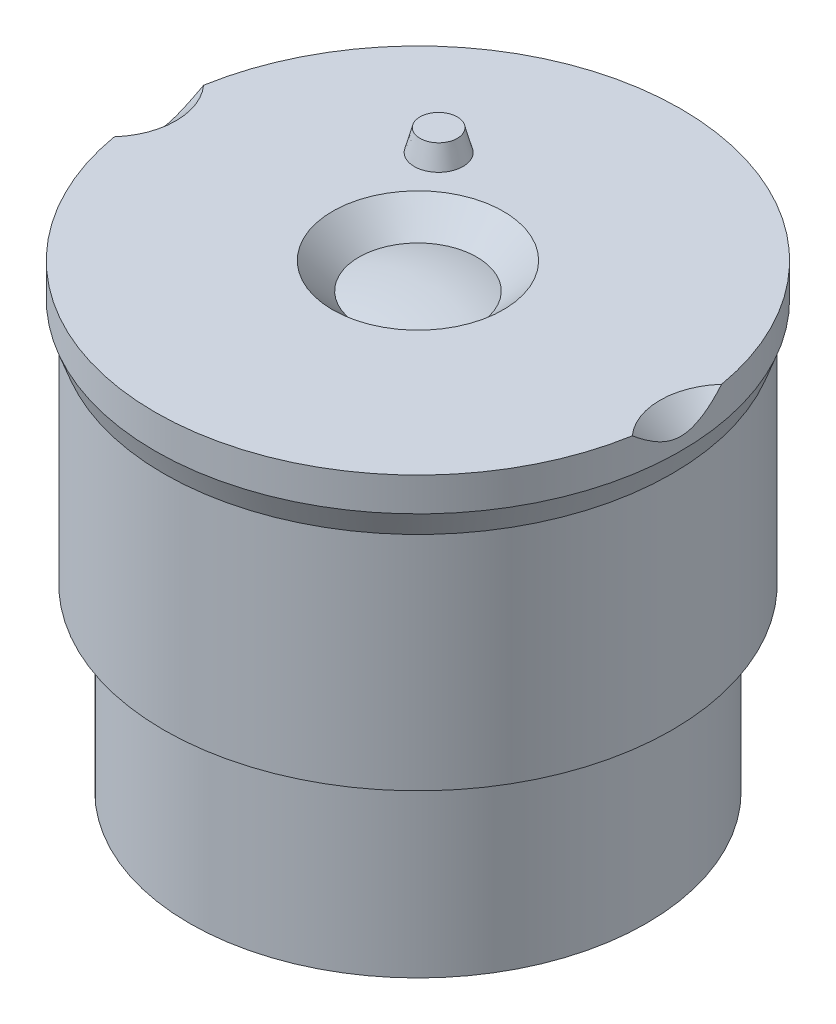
ISO-10303-21;
HEADER;
FILE_DESCRIPTION(('STEP AP214'),'2;1');
FILE_NAME('part.step','',(''),(''),'','','');
FILE_SCHEMA(('AUTOMOTIVE_DESIGN { 1 0 10303 214 1 1 1 1 }'));
ENDSEC;
DATA;
#1=APPLICATION_CONTEXT('core data for automotive mechanical design processes');
#2=APPLICATION_PROTOCOL_DEFINITION('international standard','automotive_design',2000,#1);
#3=PRODUCT_CONTEXT('',#1,'mechanical');
#4=PRODUCT('Part','Part','',(#3));
#5=PRODUCT_RELATED_PRODUCT_CATEGORY('part','',(#4));
#6=PRODUCT_DEFINITION_FORMATION('','',#4);
#7=PRODUCT_DEFINITION_CONTEXT('part definition',#1,'design');
#8=PRODUCT_DEFINITION('design','',#6,#7);
#9=PRODUCT_DEFINITION_SHAPE('','',#8);
#10=(LENGTH_UNIT() NAMED_UNIT(*) SI_UNIT(.MILLI.,.METRE.));
#11=(NAMED_UNIT(*) PLANE_ANGLE_UNIT() SI_UNIT($,.RADIAN.));
#12=(NAMED_UNIT(*) SI_UNIT($,.STERADIAN.) SOLID_ANGLE_UNIT());
#13=UNCERTAINTY_MEASURE_WITH_UNIT(LENGTH_MEASURE(1.E-05),#10,'distance_accuracy_value','');
#14=(GEOMETRIC_REPRESENTATION_CONTEXT(3) GLOBAL_UNCERTAINTY_ASSIGNED_CONTEXT((#13)) GLOBAL_UNIT_ASSIGNED_CONTEXT((#10,
#11,#12)) REPRESENTATION_CONTEXT('',''));
#15=CARTESIAN_POINT('',(0.,0.,0.));
#16=DIRECTION('',(0.,0.,1.));
#17=DIRECTION('',(1.,0.,0.));
#18=AXIS2_PLACEMENT_3D('',#15,#16,#17);
#19=CARTESIAN_POINT('',(0.,0.,0.));
#20=DIRECTION('',(0.,1.,0.));
#21=DIRECTION('',(0.,0.,1.));
#22=AXIS2_PLACEMENT_3D('',#19,#20,#21);
#23=CYLINDRICAL_SURFACE('',#22,19.55);
#24=CARTESIAN_POINT('',(0.,31.7,0.));
#25=DIRECTION('',(0.,1.,0.));
#26=DIRECTION('',(0.,0.,1.));
#27=AXIS2_PLACEMENT_3D('',#24,#25,#26);
#28=CIRCLE('',#27,19.55);
#29=CARTESIAN_POINT('',(0.,31.7,19.55));
#30=VERTEX_POINT('',#29);
#31=EDGE_CURVE('E89',#30,#30,#28,.T.);
#32=ORIENTED_EDGE('',*,*,#31,.T.);
#33=EDGE_LOOP('',(#32));
#34=FACE_BOUND('',#33,.T.);
#35=CARTESIAN_POINT('',(0.,34.2,0.));
#36=DIRECTION('',(0.,1.,0.));
#37=DIRECTION('',(0.,0.,1.));
#38=AXIS2_PLACEMENT_3D('',#35,#36,#37);
#39=CIRCLE('',#38,19.55);
#40=CARTESIAN_POINT('',(19.2652717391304,34.2,-3.32442548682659));
#41=VERTEX_POINT('',#40);
#42=CARTESIAN_POINT('',(-19.2652717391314,34.2,-3.32442548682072));
#43=VERTEX_POINT('',#42);
#44=EDGE_CURVE('E67',#41,#43,#39,.T.);
#45=ORIENTED_EDGE('',*,*,#44,.F.);
#46=CARTESIAN_POINT('',(19.26522826,34.2002,-3.32467744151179));
#47=CARTESIAN_POINT('',(19.277858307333,34.142108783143,-3.25148476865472));
#48=CARTESIAN_POINT('',(19.2901471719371,34.0845652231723,-3.17779283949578));
#49=CARTESIAN_POINT('',(19.3140284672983,33.9707877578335,-3.02926952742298));
#50=CARTESIAN_POINT('',(19.3256207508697,33.9145541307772,-2.95443790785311));
#51=CARTESIAN_POINT('',(19.3481505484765,33.8033340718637,-2.80311484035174));
#52=CARTESIAN_POINT('',(19.3590841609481,33.7483560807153,-2.72661658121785));
#53=CARTESIAN_POINT('',(19.3802035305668,33.6402774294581,-2.57221245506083));
#54=CARTESIAN_POINT('',(19.3903893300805,33.5871766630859,-2.49430666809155));
#55=CARTESIAN_POINT('',(19.4205753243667,33.4270182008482,-2.25189362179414));
#56=CARTESIAN_POINT('',(19.439290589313,33.3236424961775,-2.08475128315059));
#57=CARTESIAN_POINT('',(19.4729691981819,33.1313000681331,-1.74226302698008));
#58=CARTESIAN_POINT('',(19.4879412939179,33.0422999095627,-1.56693740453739));
#59=CARTESIAN_POINT('',(19.5069110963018,32.9263968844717,-1.30017117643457));
#60=CARTESIAN_POINT('',(19.5125708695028,32.8912436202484,-1.2124360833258));
#61=CARTESIAN_POINT('',(19.5228026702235,32.8269278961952,-1.03469822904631));
#62=CARTESIAN_POINT('',(19.5273746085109,32.7977659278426,-0.94469528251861));
#63=CARTESIAN_POINT('',(19.5352915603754,32.74679231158,-0.76355316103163));
#64=CARTESIAN_POINT('',(19.5386486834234,32.7249083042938,-0.672435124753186));
#65=CARTESIAN_POINT('',(19.5441091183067,32.6890978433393,-0.488617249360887));
#66=CARTESIAN_POINT('',(19.5462128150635,32.675168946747,-0.395917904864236));
#67=CARTESIAN_POINT('',(19.5491186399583,32.6558848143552,-0.208284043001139));
#68=CARTESIAN_POINT('',(19.5499021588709,32.6506521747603,-0.11333639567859));
#69=CARTESIAN_POINT('',(19.5500805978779,32.6494627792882,0.0766155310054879));
#70=CARTESIAN_POINT('',(19.549475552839,32.6535057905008,0.171619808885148));
#71=CARTESIAN_POINT('',(19.5468955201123,32.670644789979,0.361079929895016));
#72=CARTESIAN_POINT('',(19.5449162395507,32.6837691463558,0.455533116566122));
#73=CARTESIAN_POINT('',(19.5396531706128,32.7183458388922,0.642844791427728));
#74=CARTESIAN_POINT('',(19.5363691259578,32.7397998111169,0.735702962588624));
#75=CARTESIAN_POINT('',(19.5220306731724,32.832291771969,1.07407137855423));
#76=CARTESIAN_POINT('',(19.5072039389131,32.9259896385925,1.3133207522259));
#77=CARTESIAN_POINT('',(19.4797479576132,33.0906545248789,1.6599920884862));
#78=CARTESIAN_POINT('',(19.4696831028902,33.1498070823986,1.77388446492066));
#79=CARTESIAN_POINT('',(19.4479522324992,33.2743781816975,1.99807257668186));
#80=CARTESIAN_POINT('',(19.4362865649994,33.3397953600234,2.1083690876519));
#81=CARTESIAN_POINT('',(19.4127719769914,33.4683353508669,2.31438782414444));
#82=CARTESIAN_POINT('',(19.401069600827,33.5309835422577,2.41042858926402));
#83=CARTESIAN_POINT('',(19.3765366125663,33.659365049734,2.60028556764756));
#84=CARTESIAN_POINT('',(19.3637059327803,33.7250985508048,2.69410164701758));
#85=CARTESIAN_POINT('',(19.3371741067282,33.8579857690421,2.8783202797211));
#86=CARTESIAN_POINT('',(19.323489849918,33.9251008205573,2.96875332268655));
#87=CARTESIAN_POINT('',(19.2951103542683,34.0612843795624,3.14792210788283));
#88=CARTESIAN_POINT('',(19.2804155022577,34.1303521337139,3.23665848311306));
#89=CARTESIAN_POINT('',(19.26522826,34.2002,3.32467744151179));
#90=B_SPLINE_CURVE_WITH_KNOTS('',3,(#46,#47,#48,#49,#50,#51,#52,#53,#54,#55,#56,#57,#58,#59,#60,
#61,#62,#63,#64,#65,#66,#67,#68,#69,#70,#71,#72,#73,#74,#75,#76,#77,#78,#79,#80,#81,#82,#83,#84,
#85,#86,#87,#88,#89),.UNSPECIFIED.,.F.,.F.,(4,2,2,2,2,2,2,2,2,2,2,2,2,2,2,2,2,2,2,2,2,4),(0.,
0.28288343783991,0.565826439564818,0.850307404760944,1.13477224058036,1.72654684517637,
2.3169246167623,2.60080035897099,2.88469937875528,3.16568496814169,3.44658422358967,
3.73141089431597,4.01623041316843,4.30194368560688,4.58771310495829,5.35470851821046,
5.74086173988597,6.12693110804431,6.47265587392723,6.81840139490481,7.15870229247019,
7.4988736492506),.UNSPECIFIED.);
#91=CARTESIAN_POINT('',(19.2652717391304,34.2,3.32442548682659));
#92=VERTEX_POINT('',#91);
#93=EDGE_CURVE('E60',#41,#92,#90,.T.);
#94=ORIENTED_EDGE('',*,*,#93,.T.);
#95=CARTESIAN_POINT('',(-19.2652717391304,34.2,3.32442548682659));
#96=VERTEX_POINT('',#95);
#97=EDGE_CURVE('E80',#96,#92,#39,.T.);
#98=ORIENTED_EDGE('',*,*,#97,.F.);
#99=CARTESIAN_POINT('',(-19.26522826,34.2002,3.32467744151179));
#100=CARTESIAN_POINT('',(-19.277858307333,34.142108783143,3.25148476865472));
#101=CARTESIAN_POINT('',(-19.2901471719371,34.0845652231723,3.17779283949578));
#102=CARTESIAN_POINT('',(-19.3140284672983,33.9707877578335,3.02926952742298));
#103=CARTESIAN_POINT('',(-19.3256207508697,33.9145541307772,2.95443790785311));
#104=CARTESIAN_POINT('',(-19.3481505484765,33.8033340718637,2.80311484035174));
#105=CARTESIAN_POINT('',(-19.3590841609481,33.7483560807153,2.72661658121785));
#106=CARTESIAN_POINT('',(-19.3802035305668,33.6402774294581,2.57221245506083));
#107=CARTESIAN_POINT('',(-19.3903893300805,33.5871766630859,2.49430666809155));
#108=CARTESIAN_POINT('',(-19.4205753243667,33.4270182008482,2.25189362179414));
#109=CARTESIAN_POINT('',(-19.439290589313,33.3236424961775,2.08475128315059));
#110=CARTESIAN_POINT('',(-19.4729691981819,33.1313000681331,1.74226302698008));
#111=CARTESIAN_POINT('',(-19.4879412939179,33.0422999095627,1.56693740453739));
#112=CARTESIAN_POINT('',(-19.5069110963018,32.9263968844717,1.30017117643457));
#113=CARTESIAN_POINT('',(-19.5125708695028,32.8912436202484,1.2124360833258));
#114=CARTESIAN_POINT('',(-19.5228026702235,32.8269278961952,1.03469822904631));
#115=CARTESIAN_POINT('',(-19.5273746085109,32.7977659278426,0.94469528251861));
#116=CARTESIAN_POINT('',(-19.5352915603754,32.74679231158,0.76355316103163));
#117=CARTESIAN_POINT('',(-19.5386486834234,32.7249083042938,0.672435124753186));
#118=CARTESIAN_POINT('',(-19.5441091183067,32.6890978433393,0.488617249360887));
#119=CARTESIAN_POINT('',(-19.5462128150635,32.675168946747,0.395917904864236));
#120=CARTESIAN_POINT('',(-19.5491186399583,32.6558848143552,0.208284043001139));
#121=CARTESIAN_POINT('',(-19.5499021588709,32.6506521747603,0.11333639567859));
#122=CARTESIAN_POINT('',(-19.5500805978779,32.6494627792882,-0.0766155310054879));
#123=CARTESIAN_POINT('',(-19.549475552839,32.6535057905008,-0.171619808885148));
#124=CARTESIAN_POINT('',(-19.5468955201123,32.670644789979,-0.361079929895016));
#125=CARTESIAN_POINT('',(-19.5449162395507,32.6837691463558,-0.455533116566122));
#126=CARTESIAN_POINT('',(-19.5396531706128,32.7183458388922,-0.642844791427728));
#127=CARTESIAN_POINT('',(-19.5363691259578,32.7397998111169,-0.735702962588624));
#128=CARTESIAN_POINT('',(-19.5220306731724,32.832291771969,-1.07407137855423));
#129=CARTESIAN_POINT('',(-19.5072039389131,32.9259896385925,-1.3133207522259));
#130=CARTESIAN_POINT('',(-19.4797479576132,33.0906545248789,-1.6599920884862));
#131=CARTESIAN_POINT('',(-19.4696831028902,33.1498070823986,-1.77388446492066));
#132=CARTESIAN_POINT('',(-19.4479522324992,33.2743781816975,-1.99807257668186));
#133=CARTESIAN_POINT('',(-19.4362865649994,33.3397953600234,-2.1083690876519));
#134=CARTESIAN_POINT('',(-19.4127719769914,33.4683353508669,-2.31438782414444));
#135=CARTESIAN_POINT('',(-19.401069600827,33.5309835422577,-2.41042858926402));
#136=CARTESIAN_POINT('',(-19.3765366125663,33.659365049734,-2.60028556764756));
#137=CARTESIAN_POINT('',(-19.3637059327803,33.7250985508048,-2.69410164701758));
#138=CARTESIAN_POINT('',(-19.3371741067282,33.8579857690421,-2.8783202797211));
#139=CARTESIAN_POINT('',(-19.323489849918,33.9251008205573,-2.96875332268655));
#140=CARTESIAN_POINT('',(-19.2951103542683,34.0612843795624,-3.14792210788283));
#141=CARTESIAN_POINT('',(-19.2804155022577,34.1303521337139,-3.23665848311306));
#142=CARTESIAN_POINT('',(-19.26522826,34.2002,-3.32467744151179));
#143=B_SPLINE_CURVE_WITH_KNOTS('',3,(#99,#100,#101,#102,#103,#104,#105,#106,#107,#108,#109,#110,
#111,#112,#113,#114,#115,#116,#117,#118,#119,#120,#121,#122,#123,#124,#125,#126,#127,#128,#129,
#130,#131,#132,#133,#134,#135,#136,#137,#138,#139,#140,#141,#142),.UNSPECIFIED.,.F.,.F.,(4,2,2,
2,2,2,2,2,2,2,2,2,2,2,2,2,2,2,2,2,2,4),(0.,0.28288343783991,0.565826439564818,0.850307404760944,
1.13477224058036,1.72654684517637,2.3169246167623,2.60080035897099,2.88469937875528,
3.16568496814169,3.44658422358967,3.73141089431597,4.01623041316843,4.30194368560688,
4.58771310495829,5.35470851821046,5.74086173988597,6.12693110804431,6.47265587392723,
6.81840139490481,7.15870229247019,7.4988736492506),.UNSPECIFIED.);
#144=EDGE_CURVE('E11',#96,#43,#143,.T.);
#145=ORIENTED_EDGE('',*,*,#144,.T.);
#146=EDGE_LOOP('',(#45,#94,#98,#145));
#147=FACE_BOUND('',#146,.T.);
#148=ADVANCED_FACE('F40',(#34,#147),#23,.T.);
#149=CARTESIAN_POINT('',(0.,16.4145604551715,0.));
#150=DIRECTION('',(0.,1.,0.));
#151=DIRECTION('',(1.,0.,0.));
#152=AXIS2_PLACEMENT_3D('',#149,#150,#151);
#153=SPHERICAL_SURFACE('',#152,16.4145604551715);
#154=CARTESIAN_POINT('',(0.,32.2331008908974,0.));
#155=DIRECTION('',(0.,1.,0.));
#156=DIRECTION('',(0.,0.,1.));
#157=AXIS2_PLACEMENT_3D('',#154,#155,#156);
#158=CIRCLE('',#157,4.38310089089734);
#159=CARTESIAN_POINT('',(0.,32.2331008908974,4.38310089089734));
#160=VERTEX_POINT('',#159);
#161=EDGE_CURVE('E54',#160,#160,#158,.T.);
#162=ORIENTED_EDGE('',*,*,#161,.T.);
#163=EDGE_LOOP('',(#162));
#164=FACE_BOUND('',#163,.T.);
#165=ADVANCED_FACE('F42',(#164),#153,.T.);
#166=CARTESIAN_POINT('',(0.,32.2331008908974,0.));
#167=DIRECTION('',(0.,1.,0.));
#168=DIRECTION('',(0.,0.,1.));
#169=AXIS2_PLACEMENT_3D('',#166,#167,#168);
#170=CONICAL_SURFACE('',#169,4.38310089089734,0.785398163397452);
#171=CARTESIAN_POINT('',(0.,34.2,0.));
#172=DIRECTION('',(0.,1.,0.));
#173=DIRECTION('',(0.,0.,1.));
#174=AXIS2_PLACEMENT_3D('',#171,#172,#173);
#175=CIRCLE('',#174,6.35);
#176=CARTESIAN_POINT('',(0.,34.2,6.35));
#177=VERTEX_POINT('',#176);
#178=EDGE_CURVE('E85',#177,#177,#175,.T.);
#179=ORIENTED_EDGE('',*,*,#178,.T.);
#180=EDGE_LOOP('',(#179));
#181=FACE_BOUND('',#180,.T.);
#182=ORIENTED_EDGE('',*,*,#161,.F.);
#183=EDGE_LOOP('',(#182));
#184=FACE_BOUND('',#183,.T.);
#185=ADVANCED_FACE('F96',(#181,#184),#170,.F.);
#186=CARTESIAN_POINT('',(-19.55,34.2,0.));
#187=DIRECTION('',(0.,1.,0.));
#188=DIRECTION('',(0.,0.,1.));
#189=AXIS2_PLACEMENT_3D('',#186,#187,#188);
#190=PLANE('',#189);
#191=CARTESIAN_POINT('',(-6.1925023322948,34.2,-7.73188144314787));
#192=DIRECTION('',(0.,1.,0.));
#193=DIRECTION('',(0.,0.,1.));
#194=AXIS2_PLACEMENT_3D('',#191,#192,#193);
#195=CIRCLE('',#194,1.8145504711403);
#196=CARTESIAN_POINT('',(-6.1925023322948,34.2,-5.91733097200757));
#197=VERTEX_POINT('',#196);
#198=EDGE_CURVE('E203',#197,#197,#195,.T.);
#199=ORIENTED_EDGE('',*,*,#198,.F.);
#200=EDGE_LOOP('',(#199));
#201=FACE_BOUND('',#200,.T.);
#202=ORIENTED_EDGE('',*,*,#97,.T.);
#203=CARTESIAN_POINT('',(23.,34.2,0.));
#204=DIRECTION('',(0.,-1.,0.));
#205=DIRECTION('',(0.,0.,1.));
#206=AXIS2_PLACEMENT_3D('',#203,#204,#205);
#207=CIRCLE('',#206,5.);
#208=EDGE_CURVE('E73',#92,#41,#207,.T.);
#209=ORIENTED_EDGE('',*,*,#208,.T.);
#210=ORIENTED_EDGE('',*,*,#44,.T.);
#211=CARTESIAN_POINT('',(-23.,34.2,0.));
#212=DIRECTION('',(0.,1.,0.));
#213=DIRECTION('',(0.,0.,1.));
#214=AXIS2_PLACEMENT_3D('',#211,#212,#213);
#215=CIRCLE('',#214,5.);
#216=EDGE_CURVE('E81',#96,#43,#215,.T.);
#217=ORIENTED_EDGE('',*,*,#216,.F.);
#218=EDGE_LOOP('',(#202,#209,#210,#217));
#219=FACE_BOUND('',#218,.T.);
#220=ORIENTED_EDGE('',*,*,#178,.F.);
#221=EDGE_LOOP('',(#220));
#222=FACE_BOUND('',#221,.T.);
#223=ADVANCED_FACE('F83',(#201,#219,#222),#190,.T.);
#224=CARTESIAN_POINT('',(0.,31.7,0.));
#225=DIRECTION('',(0.,1.,0.));
#226=DIRECTION('',(0.,0.,1.));
#227=AXIS2_PLACEMENT_3D('',#224,#225,#226);
#228=CONICAL_SURFACE('',#227,19.55,0.349065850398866);
#229=CARTESIAN_POINT('',(0.,29.9141396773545,0.));
#230=DIRECTION('',(0.,1.,0.));
#231=DIRECTION('',(0.,0.,1.));
#232=AXIS2_PLACEMENT_3D('',#229,#230,#231);
#233=CIRCLE('',#232,18.9);
#234=CARTESIAN_POINT('',(0.,29.9141396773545,18.9));
#235=VERTEX_POINT('',#234);
#236=EDGE_CURVE('E157',#235,#235,#233,.T.);
#237=ORIENTED_EDGE('',*,*,#236,.T.);
#238=EDGE_LOOP('',(#237));
#239=FACE_BOUND('',#238,.T.);
#240=ORIENTED_EDGE('',*,*,#31,.F.);
#241=EDGE_LOOP('',(#240));
#242=FACE_BOUND('',#241,.T.);
#243=ADVANCED_FACE('F103',(#239,#242),#228,.T.);
#244=CARTESIAN_POINT('',(0.,0.,0.));
#245=DIRECTION('',(0.,1.,0.));
#246=DIRECTION('',(0.,0.,1.));
#247=AXIS2_PLACEMENT_3D('',#244,#245,#246);
#248=CYLINDRICAL_SURFACE('',#247,18.9);
#249=CARTESIAN_POINT('',(0.,13.4,0.));
#250=DIRECTION('',(0.,1.,0.));
#251=DIRECTION('',(0.,0.,1.));
#252=AXIS2_PLACEMENT_3D('',#249,#250,#251);
#253=CIRCLE('',#252,18.9);
#254=CARTESIAN_POINT('',(0.,13.4,18.9));
#255=VERTEX_POINT('',#254);
#256=EDGE_CURVE('E154',#255,#255,#253,.T.);
#257=ORIENTED_EDGE('',*,*,#256,.T.);
#258=EDGE_LOOP('',(#257));
#259=FACE_BOUND('',#258,.T.);
#260=ORIENTED_EDGE('',*,*,#236,.F.);
#261=EDGE_LOOP('',(#260));
#262=FACE_BOUND('',#261,.T.);
#263=ADVANCED_FACE('F143',(#259,#262),#248,.T.);
#264=CARTESIAN_POINT('',(-17.,13.4,0.));
#265=DIRECTION('',(0.,-1.,0.));
#266=DIRECTION('',(0.,0.,-1.));
#267=AXIS2_PLACEMENT_3D('',#264,#265,#266);
#268=PLANE('',#267);
#269=CARTESIAN_POINT('',(0.,13.4,0.));
#270=DIRECTION('',(0.,1.,0.));
#271=DIRECTION('',(0.,0.,1.));
#272=AXIS2_PLACEMENT_3D('',#269,#270,#271);
#273=CIRCLE('',#272,17.);
#274=CARTESIAN_POINT('',(0.,13.4,17.));
#275=VERTEX_POINT('',#274);
#276=EDGE_CURVE('E158',#275,#275,#273,.T.);
#277=ORIENTED_EDGE('',*,*,#276,.T.);
#278=EDGE_LOOP('',(#277));
#279=FACE_BOUND('',#278,.T.);
#280=ORIENTED_EDGE('',*,*,#256,.F.);
#281=EDGE_LOOP('',(#280));
#282=FACE_BOUND('',#281,.T.);
#283=ADVANCED_FACE('F140',(#279,#282),#268,.T.);
#284=CARTESIAN_POINT('',(0.,0.,0.));
#285=DIRECTION('',(0.,1.,0.));
#286=DIRECTION('',(0.,0.,1.));
#287=AXIS2_PLACEMENT_3D('',#284,#285,#286);
#288=CYLINDRICAL_SURFACE('',#287,17.);
#289=CARTESIAN_POINT('',(0.,0.,0.));
#290=DIRECTION('',(0.,1.,0.));
#291=DIRECTION('',(0.,0.,1.));
#292=AXIS2_PLACEMENT_3D('',#289,#290,#291);
#293=CIRCLE('',#292,17.);
#294=CARTESIAN_POINT('',(0.,0.,17.));
#295=VERTEX_POINT('',#294);
#296=EDGE_CURVE('E162',#295,#295,#293,.T.);
#297=ORIENTED_EDGE('',*,*,#296,.T.);
#298=EDGE_LOOP('',(#297));
#299=FACE_BOUND('',#298,.T.);
#300=ORIENTED_EDGE('',*,*,#276,.F.);
#301=EDGE_LOOP('',(#300));
#302=FACE_BOUND('',#301,.T.);
#303=ADVANCED_FACE('F136',(#299,#302),#288,.T.);
#304=CARTESIAN_POINT('',(0.,0.,0.));
#305=DIRECTION('',(0.,-1.,0.));
#306=DIRECTION('',(0.,0.,-1.));
#307=AXIS2_PLACEMENT_3D('',#304,#305,#306);
#308=PLANE('',#307);
#309=ORIENTED_EDGE('',*,*,#296,.F.);
#310=EDGE_LOOP('',(#309));
#311=FACE_BOUND('',#310,.T.);
#312=ADVANCED_FACE('F132',(#311),#308,.T.);
#313=CARTESIAN_POINT('',(-23.,29.1999999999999,0.));
#314=DIRECTION('',(0.,1.,0.));
#315=DIRECTION('',(0.,0.,1.));
#316=AXIS2_PLACEMENT_3D('',#313,#314,#315);
#317=CONICAL_SURFACE('',#316,0.,0.785398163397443);
#318=ORIENTED_EDGE('',*,*,#216,.T.);
#319=ORIENTED_EDGE('',*,*,#144,.F.);
#320=EDGE_LOOP('',(#318,#319));
#321=FACE_BOUND('',#320,.T.);
#322=ADVANCED_FACE('F127',(#321),#317,.F.);
#323=CARTESIAN_POINT('',(23.,29.1999999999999,0.));
#324=DIRECTION('',(0.,1.,0.));
#325=DIRECTION('',(0.,0.,1.));
#326=AXIS2_PLACEMENT_3D('',#323,#324,#325);
#327=CONICAL_SURFACE('',#326,0.,0.785398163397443);
#328=ORIENTED_EDGE('',*,*,#208,.F.);
#329=ORIENTED_EDGE('',*,*,#93,.F.);
#330=EDGE_LOOP('',(#328,#329));
#331=FACE_BOUND('',#330,.T.);
#332=ADVANCED_FACE('F74',(#331),#327,.F.);
#333=CARTESIAN_POINT('',(-6.1925023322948,34.2,-7.73188144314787));
#334=DIRECTION('',(0.,-1.,0.));
#335=DIRECTION('',(0.,0.,1.));
#336=AXIS2_PLACEMENT_3D('',#333,#334,#335);
#337=CONICAL_SURFACE('',#336,1.8145504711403,0.261799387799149);
#338=CARTESIAN_POINT('',(-6.1925023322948,35.8,-7.73188144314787));
#339=DIRECTION('',(0.,1.,0.));
#340=DIRECTION('',(0.,0.,1.));
#341=AXIS2_PLACEMENT_3D('',#338,#339,#340);
#342=CIRCLE('',#341,1.3858317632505);
#343=CARTESIAN_POINT('',(-6.1925023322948,35.8,-6.34604967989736));
#344=VERTEX_POINT('',#343);
#345=EDGE_CURVE('E76',#344,#344,#342,.T.);
#346=ORIENTED_EDGE('',*,*,#345,.F.);
#347=EDGE_LOOP('',(#346));
#348=FACE_BOUND('',#347,.T.);
#349=ORIENTED_EDGE('',*,*,#198,.T.);
#350=EDGE_LOOP('',(#349));
#351=FACE_BOUND('',#350,.T.);
#352=ADVANCED_FACE('F126',(#348,#351),#337,.T.);
#353=CARTESIAN_POINT('',(-6.1925023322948,35.8,-7.73188144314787));
#354=DIRECTION('',(0.,1.,0.));
#355=DIRECTION('',(0.,0.,1.));
#356=AXIS2_PLACEMENT_3D('',#353,#354,#355);
#357=PLANE('',#356);
#358=ORIENTED_EDGE('',*,*,#345,.T.);
#359=EDGE_LOOP('',(#358));
#360=FACE_BOUND('',#359,.T.);
#361=ADVANCED_FACE('F189',(#360),#357,.T.);
#362=CLOSED_SHELL('',(#148,#165,#185,#223,#243,#263,#283,#303,#312,#322,#332,#352,#361));
#363=MANIFOLD_SOLID_BREP('B2',#362);
#364=ADVANCED_BREP_SHAPE_REPRESENTATION('',(#18,#363),#14);
#365=SHAPE_DEFINITION_REPRESENTATION(#9,#364);
ENDSEC;
END-ISO-10303-21;
